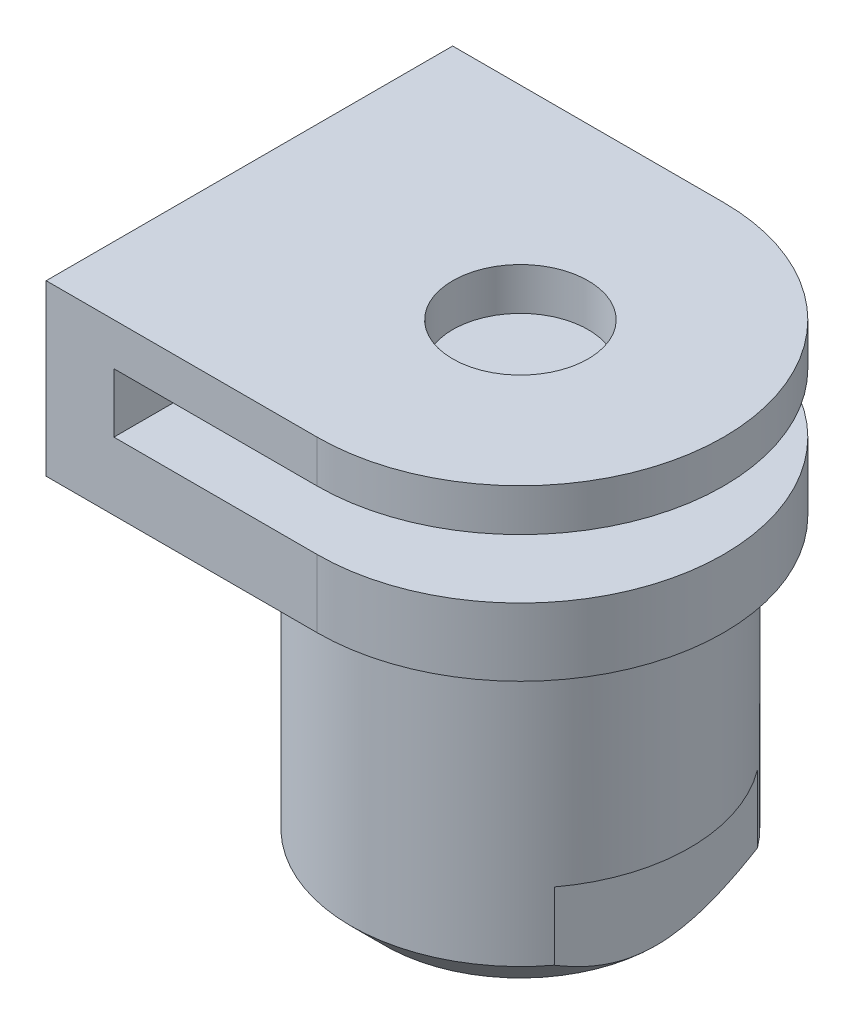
ISO-10303-21;
HEADER;
FILE_DESCRIPTION(('STEP AP214'),'2;1');
FILE_NAME('part.step','',(''),(''),'','','');
FILE_SCHEMA(('AUTOMOTIVE_DESIGN { 1 0 10303 214 1 1 1 1 }'));
ENDSEC;
DATA;
#1=APPLICATION_CONTEXT('core data for automotive mechanical design processes');
#2=APPLICATION_PROTOCOL_DEFINITION('international standard','automotive_design',2000,#1);
#3=PRODUCT_CONTEXT('',#1,'mechanical');
#4=PRODUCT('Part','Part','',(#3));
#5=PRODUCT_RELATED_PRODUCT_CATEGORY('part','',(#4));
#6=PRODUCT_DEFINITION_FORMATION('','',#4);
#7=PRODUCT_DEFINITION_CONTEXT('part definition',#1,'design');
#8=PRODUCT_DEFINITION('design','',#6,#7);
#9=PRODUCT_DEFINITION_SHAPE('','',#8);
#10=(LENGTH_UNIT() NAMED_UNIT(*) SI_UNIT(.MILLI.,.METRE.));
#11=(NAMED_UNIT(*) PLANE_ANGLE_UNIT() SI_UNIT($,.RADIAN.));
#12=(NAMED_UNIT(*) SI_UNIT($,.STERADIAN.) SOLID_ANGLE_UNIT());
#13=UNCERTAINTY_MEASURE_WITH_UNIT(LENGTH_MEASURE(1.E-05),#10,'distance_accuracy_value','');
#14=(GEOMETRIC_REPRESENTATION_CONTEXT(3) GLOBAL_UNCERTAINTY_ASSIGNED_CONTEXT((#13)) GLOBAL_UNIT_ASSIGNED_CONTEXT((#10,
#11,#12)) REPRESENTATION_CONTEXT('',''));
#15=CARTESIAN_POINT('',(0.,0.,0.));
#16=DIRECTION('',(0.,0.,1.));
#17=DIRECTION('',(1.,0.,0.));
#18=AXIS2_PLACEMENT_3D('',#15,#16,#17);
#19=CARTESIAN_POINT('',(0.,9.,0.));
#20=DIRECTION('',(0.,1.,0.));
#21=DIRECTION('',(0.,0.,1.));
#22=AXIS2_PLACEMENT_3D('',#19,#20,#21);
#23=PLANE('',#22);
#24=DIRECTION('',(1.,0.,0.));
#25=VECTOR('',#24,1.);
#26=CARTESIAN_POINT('',(-8.,9.,0.5));
#27=LINE('',#26,#25);
#28=CARTESIAN_POINT('',(-8.,9.,0.5));
#29=VERTEX_POINT('',#28);
#30=CARTESIAN_POINT('',(-4.9749371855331,9.,0.5));
#31=VERTEX_POINT('',#30);
#32=EDGE_CURVE('E61',#29,#31,#27,.T.);
#33=ORIENTED_EDGE('',*,*,#32,.T.);
#34=CARTESIAN_POINT('',(0.,9.,0.));
#35=DIRECTION('',(0.,1.,0.));
#36=DIRECTION('',(0.,0.,1.));
#37=AXIS2_PLACEMENT_3D('',#34,#35,#36);
#38=CIRCLE('',#37,5.);
#39=CARTESIAN_POINT('',(-4.9749371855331,9.,-0.5));
#40=VERTEX_POINT('',#39);
#41=EDGE_CURVE('E263',#31,#40,#38,.T.);
#42=ORIENTED_EDGE('',*,*,#41,.T.);
#43=DIRECTION('',(-1.,0.,0.));
#44=VECTOR('',#43,1.);
#45=CARTESIAN_POINT('',(6.001,9.,-0.5));
#46=LINE('',#45,#44);
#47=CARTESIAN_POINT('',(-8.,9.,-0.5));
#48=VERTEX_POINT('',#47);
#49=EDGE_CURVE('E183',#40,#48,#46,.T.);
#50=ORIENTED_EDGE('',*,*,#49,.T.);
#51=DIRECTION('',(0.,0.,1.));
#52=VECTOR('',#51,1.);
#53=CARTESIAN_POINT('',(-8.,9.,-6.));
#54=LINE('',#53,#52);
#55=CARTESIAN_POINT('',(-8.,9.,-6.));
#56=VERTEX_POINT('',#55);
#57=EDGE_CURVE('E198',#56,#48,#54,.T.);
#58=ORIENTED_EDGE('',*,*,#57,.F.);
#59=DIRECTION('',(-1.,0.,0.));
#60=VECTOR('',#59,1.);
#61=CARTESIAN_POINT('',(0.,9.,-6.));
#62=LINE('',#61,#60);
#63=CARTESIAN_POINT('',(0.,9.,-6.));
#64=VERTEX_POINT('',#63);
#65=EDGE_CURVE('E234',#64,#56,#62,.T.);
#66=ORIENTED_EDGE('',*,*,#65,.F.);
#67=CARTESIAN_POINT('',(0.,9.,0.));
#68=DIRECTION('',(0.,1.,0.));
#69=DIRECTION('',(0.,0.,1.));
#70=AXIS2_PLACEMENT_3D('',#67,#68,#69);
#71=CIRCLE('',#70,6.);
#72=CARTESIAN_POINT('',(0.,9.,6.));
#73=VERTEX_POINT('',#72);
#74=EDGE_CURVE('E218',#73,#64,#71,.T.);
#75=ORIENTED_EDGE('',*,*,#74,.F.);
#76=DIRECTION('',(1.,0.,0.));
#77=VECTOR('',#76,1.);
#78=CARTESIAN_POINT('',(-6.,9.,6.));
#79=LINE('',#78,#77);
#80=CARTESIAN_POINT('',(-8.,9.,6.));
#81=VERTEX_POINT('',#80);
#82=EDGE_CURVE('E223',#81,#73,#79,.T.);
#83=ORIENTED_EDGE('',*,*,#82,.F.);
#84=EDGE_CURVE('E195',#29,#81,#54,.T.);
#85=ORIENTED_EDGE('',*,*,#84,.F.);
#86=EDGE_LOOP('',(#33,#42,#50,#58,#66,#75,#83,#85));
#87=FACE_BOUND('',#86,.T.);
#88=ADVANCED_FACE('F35',(#87),#23,.F.);
#89=CARTESIAN_POINT('',(0.,9.,0.));
#90=DIRECTION('',(0.,-1.,0.));
#91=DIRECTION('',(0.,0.,-1.));
#92=AXIS2_PLACEMENT_3D('',#89,#90,#91);
#93=CYLINDRICAL_SURFACE('',#92,5.);
#94=CARTESIAN_POINT('',(0.,3.,0.));
#95=DIRECTION('',(0.,-1.,0.));
#96=DIRECTION('',(0.,0.,-1.));
#97=AXIS2_PLACEMENT_3D('',#94,#95,#96);
#98=CIRCLE('',#97,5.);
#99=CARTESIAN_POINT('',(4.,3.,-3.));
#100=VERTEX_POINT('',#99);
#101=CARTESIAN_POINT('',(4.,3.,3.));
#102=VERTEX_POINT('',#101);
#103=EDGE_CURVE('E12',#100,#102,#98,.T.);
#104=ORIENTED_EDGE('',*,*,#103,.F.);
#105=DIRECTION('',(0.,-1.,0.));
#106=VECTOR('',#105,1.);
#107=CARTESIAN_POINT('',(4.,9.,-3.));
#108=LINE('',#107,#106);
#109=CARTESIAN_POINT('',(4.,1.00000000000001,-3.00000000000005));
#110=VERTEX_POINT('',#109);
#111=EDGE_CURVE('E257',#100,#110,#108,.T.);
#112=ORIENTED_EDGE('',*,*,#111,.T.);
#113=CARTESIAN_POINT('',(0.,1.,0.));
#114=DIRECTION('',(0.,1.,0.));
#115=DIRECTION('',(0.,0.,1.));
#116=AXIS2_PLACEMENT_3D('',#113,#114,#115);
#117=CIRCLE('',#116,5.);
#118=CARTESIAN_POINT('',(-4.,1.00000000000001,-3.00000000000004));
#119=VERTEX_POINT('',#118);
#120=EDGE_CURVE('E268',#110,#119,#117,.T.);
#121=ORIENTED_EDGE('',*,*,#120,.T.);
#122=DIRECTION('',(0.,-1.,0.));
#123=VECTOR('',#122,1.);
#124=CARTESIAN_POINT('',(-4.,9.,-3.));
#125=LINE('',#124,#123);
#126=CARTESIAN_POINT('',(-4.,3.,-3.));
#127=VERTEX_POINT('',#126);
#128=EDGE_CURVE('E246',#119,#127,#125,.F.);
#129=ORIENTED_EDGE('',*,*,#128,.T.);
#130=CARTESIAN_POINT('',(0.,3.,0.));
#131=DIRECTION('',(0.,1.,0.));
#132=DIRECTION('',(0.,0.,1.));
#133=AXIS2_PLACEMENT_3D('',#130,#131,#132);
#134=CIRCLE('',#133,5.);
#135=CARTESIAN_POINT('',(-4.,3.,3.));
#136=VERTEX_POINT('',#135);
#137=EDGE_CURVE('E45',#127,#136,#134,.T.);
#138=ORIENTED_EDGE('',*,*,#137,.T.);
#139=DIRECTION('',(0.,-1.,0.));
#140=VECTOR('',#139,1.);
#141=CARTESIAN_POINT('',(-4.,9.,3.));
#142=LINE('',#141,#140);
#143=CARTESIAN_POINT('',(-4.,1.,3.));
#144=VERTEX_POINT('',#143);
#145=EDGE_CURVE('E251',#136,#144,#142,.T.);
#146=ORIENTED_EDGE('',*,*,#145,.T.);
#147=CARTESIAN_POINT('',(4.,1.,3.));
#148=VERTEX_POINT('',#147);
#149=EDGE_CURVE('E265',#144,#148,#117,.T.);
#150=ORIENTED_EDGE('',*,*,#149,.T.);
#151=DIRECTION('',(0.,-1.,0.));
#152=VECTOR('',#151,1.);
#153=CARTESIAN_POINT('',(4.,9.,3.));
#154=LINE('',#153,#152);
#155=EDGE_CURVE('E254',#148,#102,#154,.F.);
#156=ORIENTED_EDGE('',*,*,#155,.T.);
#157=EDGE_LOOP('',(#104,#112,#121,#129,#138,#146,#150,#156));
#158=FACE_BOUND('',#157,.T.);
#159=DIRECTION('',(0.,-1.,0.));
#160=VECTOR('',#159,1.);
#161=CARTESIAN_POINT('',(-4.9749371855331,9.,0.5));
#162=LINE('',#161,#160);
#163=CARTESIAN_POINT('',(-4.9749371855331,5.,0.5));
#164=VERTEX_POINT('',#163);
#165=EDGE_CURVE('E53',#31,#164,#162,.T.);
#166=ORIENTED_EDGE('',*,*,#165,.T.);
#167=CARTESIAN_POINT('',(0.,5.,0.));
#168=DIRECTION('',(0.,1.,0.));
#169=DIRECTION('',(0.,0.,1.));
#170=AXIS2_PLACEMENT_3D('',#167,#168,#169);
#171=CIRCLE('',#170,5.);
#172=CARTESIAN_POINT('',(-5.,5.,0.));
#173=VERTEX_POINT('',#172);
#174=EDGE_CURVE('E178',#164,#173,#171,.F.);
#175=ORIENTED_EDGE('',*,*,#174,.T.);
#176=CARTESIAN_POINT('',(0.,5.,0.));
#177=DIRECTION('',(0.,1.,0.));
#178=DIRECTION('',(0.,0.,1.));
#179=AXIS2_PLACEMENT_3D('',#176,#177,#178);
#180=CIRCLE('',#179,5.);
#181=CARTESIAN_POINT('',(-4.9749371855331,5.,-0.5));
#182=VERTEX_POINT('',#181);
#183=EDGE_CURVE('E556',#173,#182,#180,.F.);
#184=ORIENTED_EDGE('',*,*,#183,.T.);
#185=DIRECTION('',(0.,-1.,0.));
#186=VECTOR('',#185,1.);
#187=CARTESIAN_POINT('',(-4.9749371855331,9.,-0.5));
#188=LINE('',#187,#186);
#189=EDGE_CURVE('E190',#182,#40,#188,.F.);
#190=ORIENTED_EDGE('',*,*,#189,.T.);
#191=ORIENTED_EDGE('',*,*,#41,.F.);
#192=EDGE_LOOP('',(#166,#175,#184,#190,#191));
#193=FACE_BOUND('',#192,.T.);
#194=ADVANCED_FACE('F304',(#158,#193),#93,.T.);
#195=CARTESIAN_POINT('',(-6.,9.,-6.));
#196=DIRECTION('',(1.,0.,0.));
#197=DIRECTION('',(0.,0.,-1.));
#198=AXIS2_PLACEMENT_3D('',#195,#196,#197);
#199=PLANE('',#198);
#200=DIRECTION('',(0.,1.,0.));
#201=VECTOR('',#200,1.);
#202=CARTESIAN_POINT('',(-6.,9.,-6.));
#203=LINE('',#202,#201);
#204=CARTESIAN_POINT('',(-6.,11.,-6.));
#205=VERTEX_POINT('',#204);
#206=CARTESIAN_POINT('',(-6.,12.75,-6.));
#207=VERTEX_POINT('',#206);
#208=EDGE_CURVE('E213',#205,#207,#203,.T.);
#209=ORIENTED_EDGE('',*,*,#208,.T.);
#210=DIRECTION('',(0.,0.,1.));
#211=VECTOR('',#210,1.);
#212=CARTESIAN_POINT('',(-6.,12.75,-6.));
#213=LINE('',#212,#211);
#214=CARTESIAN_POINT('',(-6.,12.75,6.));
#215=VERTEX_POINT('',#214);
#216=EDGE_CURVE('E586',#207,#215,#213,.T.);
#217=ORIENTED_EDGE('',*,*,#216,.T.);
#218=DIRECTION('',(0.,1.,0.));
#219=VECTOR('',#218,1.);
#220=CARTESIAN_POINT('',(-6.,9.,6.));
#221=LINE('',#220,#219);
#222=CARTESIAN_POINT('',(-6.,11.,6.));
#223=VERTEX_POINT('',#222);
#224=EDGE_CURVE('E204',#223,#215,#221,.T.);
#225=ORIENTED_EDGE('',*,*,#224,.F.);
#226=DIRECTION('',(0.,0.,1.));
#227=VECTOR('',#226,1.);
#228=CARTESIAN_POINT('',(-6.,11.,-6.));
#229=LINE('',#228,#227);
#230=EDGE_CURVE('E226',#205,#223,#229,.T.);
#231=ORIENTED_EDGE('',*,*,#230,.F.);
#232=EDGE_LOOP('',(#209,#217,#225,#231));
#233=FACE_BOUND('',#232,.T.);
#234=ADVANCED_FACE('F306',(#233),#199,.T.);
#235=CARTESIAN_POINT('',(0.,1.,0.));
#236=DIRECTION('',(0.,1.,0.));
#237=DIRECTION('',(0.,0.,1.));
#238=AXIS2_PLACEMENT_3D('',#235,#236,#237);
#239=CONICAL_SURFACE('',#238,5.,0.785398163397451);
#240=CARTESIAN_POINT('',(4.,4.98945966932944,-8.05048974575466));
#241=CARTESIAN_POINT('',(4.,4.82495657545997,-7.86677314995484));
#242=CARTESIAN_POINT('',(4.,4.6610445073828,-7.68252259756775));
#243=CARTESIAN_POINT('',(4.,4.33471600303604,-7.31267247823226));
#244=CARTESIAN_POINT('',(4.,4.17229970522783,-7.12707278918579));
#245=CARTESIAN_POINT('',(4.,3.84870393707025,-6.75358129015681));
#246=CARTESIAN_POINT('',(4.,3.68753134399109,-6.5656835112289));
#247=CARTESIAN_POINT('',(4.,3.36751725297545,-6.18792336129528));
#248=CARTESIAN_POINT('',(4.,3.20867565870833,-5.99806107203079));
#249=CARTESIAN_POINT('',(4.,2.88467626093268,-5.60463737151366));
#250=CARTESIAN_POINT('',(4.,2.7196977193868,-5.40092791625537));
#251=CARTESIAN_POINT('',(4.,2.39412100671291,-4.99004131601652));
#252=CARTESIAN_POINT('',(4.,2.23352259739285,-4.78286436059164));
#253=CARTESIAN_POINT('',(4.,1.91848935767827,-4.36434256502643));
#254=CARTESIAN_POINT('',(4.,1.76404563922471,-4.15300444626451));
#255=CARTESIAN_POINT('',(4.,1.46342148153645,-3.72455976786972));
#256=CARTESIAN_POINT('',(4.,1.31723853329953,-3.50745498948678));
#257=CARTESIAN_POINT('',(4.,1.07455586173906,-3.12515751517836));
#258=CARTESIAN_POINT('',(4.,0.975280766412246,-2.96173607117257));
#259=CARTESIAN_POINT('',(4.,0.785179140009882,-2.62991642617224));
#260=CARTESIAN_POINT('',(4.,0.694355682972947,-2.46151644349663));
#261=CARTESIAN_POINT('',(4.,0.524899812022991,-2.12047804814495));
#262=CARTESIAN_POINT('',(4.,0.446166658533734,-1.94789030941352));
#263=CARTESIAN_POINT('',(4.,0.303868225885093,-1.59655754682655));
#264=CARTESIAN_POINT('',(4.,0.240291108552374,-1.41781745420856));
#265=CARTESIAN_POINT('',(4.,0.152093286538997,-1.11909704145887));
#266=CARTESIAN_POINT('',(4.,0.121660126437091,-1.00083492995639));
#267=CARTESIAN_POINT('',(4.,0.0703149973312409,-0.762246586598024));
#268=CARTESIAN_POINT('',(4.,0.0494014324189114,-0.641920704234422));
#269=CARTESIAN_POINT('',(4.,0.018210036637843,-0.400362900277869));
#270=CARTESIAN_POINT('',(4.,0.00789045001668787,-0.279136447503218));
#271=CARTESIAN_POINT('',(4.,-0.00167644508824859,-0.0362406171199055));
#272=CARTESIAN_POINT('',(4.,-0.000923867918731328,0.0854287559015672));
#273=CARTESIAN_POINT('',(4.,0.011582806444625,0.327677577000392));
#274=CARTESIAN_POINT('',(4.,0.0232906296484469,0.448259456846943));
#275=CARTESIAN_POINT('',(4.,0.0569967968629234,0.68798211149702));
#276=CARTESIAN_POINT('',(4.,0.078997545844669,0.807122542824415));
#277=CARTESIAN_POINT('',(4.,0.13253015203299,1.04468446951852));
#278=CARTESIAN_POINT('',(4.,0.164170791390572,1.16308113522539));
#279=CARTESIAN_POINT('',(4.,0.235577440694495,1.39734273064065));
#280=CARTESIAN_POINT('',(4.,0.275342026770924,1.51320810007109));
#281=CARTESIAN_POINT('',(4.,0.374287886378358,1.77572186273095));
#282=CARTESIAN_POINT('',(4.,0.435751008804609,1.92150570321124));
#283=CARTESIAN_POINT('',(4.,0.567638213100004,2.208992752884));
#284=CARTESIAN_POINT('',(4.,0.638067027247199,2.35069375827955));
#285=CARTESIAN_POINT('',(4.,0.786162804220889,2.63088310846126));
#286=CARTESIAN_POINT('',(4.,0.863854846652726,2.7693580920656));
#287=CARTESIAN_POINT('',(4.,1.02471777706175,3.0430311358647));
#288=CARTESIAN_POINT('',(4.,1.1078876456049,3.17822979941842));
#289=CARTESIAN_POINT('',(4.,1.27435701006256,3.43924936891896));
#290=CARTESIAN_POINT('',(4.,1.35744794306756,3.5652039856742));
#291=CARTESIAN_POINT('',(4.,1.52680425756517,3.8149685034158));
#292=CARTESIAN_POINT('',(4.,1.61306989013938,3.93877823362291));
#293=CARTESIAN_POINT('',(4.,1.78741756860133,4.18348220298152));
#294=CARTESIAN_POINT('',(4.,1.87547722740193,4.3043924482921));
#295=CARTESIAN_POINT('',(4.,2.05368586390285,4.54461496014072));
#296=CARTESIAN_POINT('',(4.,2.14383427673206,4.66392764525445));
#297=CARTESIAN_POINT('',(4.,2.23482802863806,4.7825809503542));
#298=B_SPLINE_CURVE_WITH_KNOTS('',3,(#240,#241,#242,#243,#244,#245,#246,#247,#248,#249,#250,
#251,#252,#253,#254,#255,#256,#257,#258,#259,#260,#261,#262,#263,#264,#265,#266,#267,#268,#269,
#270,#271,#272,#273,#274,#275,#276,#277,#278,#279,#280,#281,#282,#283,#284,#285,#286,#287,#288,
#289,#290,#291,#292,#293,#294,#295,#296,#297),.UNSPECIFIED.,.F.,.F.,(4,2,2,2,2,2,2,2,2,2,2,2,2,
2,2,2,2,2,2,2,2,2,2,2,2,2,2,2,4),(0.,0.739813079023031,1.47969396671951,2.22233588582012,
2.96494702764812,3.75131185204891,4.53763382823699,5.32277576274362,6.10767793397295,
6.68113117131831,7.25479217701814,7.82337832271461,8.39151888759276,8.75753515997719,
9.12349004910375,9.48799693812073,9.85250006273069,10.2154704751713,10.578525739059,
10.9458400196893,11.3130899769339,11.7873179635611,12.2617973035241,12.7379801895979,
13.2140747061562,13.6666961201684,14.1193534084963,14.5680650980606,15.0166568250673),.UNSPECIFIED.);
#299=CARTESIAN_POINT('',(3.99999999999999,0.,0.));
#300=VERTEX_POINT('',#299);
#301=EDGE_CURVE('E324',#148,#300,#298,.F.);
#302=ORIENTED_EDGE('',*,*,#301,.F.);
#303=ORIENTED_EDGE('',*,*,#149,.F.);
#304=CARTESIAN_POINT('',(-4.,4.98945966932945,-8.05048974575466));
#305=CARTESIAN_POINT('',(-4.,4.82495657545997,-7.86677314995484));
#306=CARTESIAN_POINT('',(-4.,4.6610445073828,-7.68252259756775));
#307=CARTESIAN_POINT('',(-4.,4.33471600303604,-7.31267247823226));
#308=CARTESIAN_POINT('',(-4.,4.17229970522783,-7.12707278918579));
#309=CARTESIAN_POINT('',(-4.,3.84870393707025,-6.75358129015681));
#310=CARTESIAN_POINT('',(-4.,3.68753134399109,-6.5656835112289));
#311=CARTESIAN_POINT('',(-4.,3.36751725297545,-6.18792336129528));
#312=CARTESIAN_POINT('',(-4.,3.20867565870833,-5.99806107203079));
#313=CARTESIAN_POINT('',(-4.,2.88467626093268,-5.60463737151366));
#314=CARTESIAN_POINT('',(-4.,2.7196977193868,-5.40092791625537));
#315=CARTESIAN_POINT('',(-4.,2.39412100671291,-4.99004131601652));
#316=CARTESIAN_POINT('',(-4.,2.23352259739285,-4.78286436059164));
#317=CARTESIAN_POINT('',(-4.,1.91848935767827,-4.36434256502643));
#318=CARTESIAN_POINT('',(-4.,1.76404563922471,-4.15300444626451));
#319=CARTESIAN_POINT('',(-4.,1.46342148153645,-3.72455976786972));
#320=CARTESIAN_POINT('',(-4.,1.31723853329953,-3.50745498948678));
#321=CARTESIAN_POINT('',(-4.,1.07455586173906,-3.12515751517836));
#322=CARTESIAN_POINT('',(-4.,0.975280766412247,-2.96173607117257));
#323=CARTESIAN_POINT('',(-4.,0.785179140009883,-2.62991642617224));
#324=CARTESIAN_POINT('',(-4.,0.694355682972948,-2.46151644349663));
#325=CARTESIAN_POINT('',(-4.,0.524899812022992,-2.12047804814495));
#326=CARTESIAN_POINT('',(-4.,0.446166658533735,-1.94789030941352));
#327=CARTESIAN_POINT('',(-4.,0.303868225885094,-1.59655754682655));
#328=CARTESIAN_POINT('',(-4.,0.240291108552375,-1.41781745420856));
#329=CARTESIAN_POINT('',(-4.,0.152093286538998,-1.11909704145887));
#330=CARTESIAN_POINT('',(-4.,0.121660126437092,-1.00083492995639));
#331=CARTESIAN_POINT('',(-4.,0.0703149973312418,-0.762246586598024));
#332=CARTESIAN_POINT('',(-4.,0.0494014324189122,-0.641920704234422));
#333=CARTESIAN_POINT('',(-4.,0.0182100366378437,-0.400362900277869));
#334=CARTESIAN_POINT('',(-4.,0.00789045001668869,-0.279136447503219));
#335=CARTESIAN_POINT('',(-4.,-0.00167644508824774,-0.036240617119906));
#336=CARTESIAN_POINT('',(-4.,-0.00092386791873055,0.0854287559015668));
#337=CARTESIAN_POINT('',(-4.,0.0115828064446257,0.327677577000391));
#338=CARTESIAN_POINT('',(-4.,0.0232906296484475,0.448259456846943));
#339=CARTESIAN_POINT('',(-4.,0.0569967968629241,0.68798211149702));
#340=CARTESIAN_POINT('',(-4.,0.0789975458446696,0.807122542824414));
#341=CARTESIAN_POINT('',(-4.,0.132530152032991,1.04468446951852));
#342=CARTESIAN_POINT('',(-4.,0.164170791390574,1.16308113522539));
#343=CARTESIAN_POINT('',(-4.,0.235577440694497,1.39734273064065));
#344=CARTESIAN_POINT('',(-4.,0.275342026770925,1.51320810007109));
#345=CARTESIAN_POINT('',(-4.,0.374287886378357,1.77572186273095));
#346=CARTESIAN_POINT('',(-4.,0.435751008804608,1.92150570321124));
#347=CARTESIAN_POINT('',(-4.,0.567638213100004,2.208992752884));
#348=CARTESIAN_POINT('',(-4.,0.638067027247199,2.35069375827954));
#349=CARTESIAN_POINT('',(-4.,0.786162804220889,2.63088310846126));
#350=CARTESIAN_POINT('',(-4.,0.863854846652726,2.76935809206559));
#351=CARTESIAN_POINT('',(-4.,1.02471777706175,3.04303113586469));
#352=CARTESIAN_POINT('',(-4.,1.1078876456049,3.17822979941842));
#353=CARTESIAN_POINT('',(-4.,1.27435701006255,3.43924936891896));
#354=CARTESIAN_POINT('',(-4.,1.35744794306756,3.5652039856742));
#355=CARTESIAN_POINT('',(-4.,1.52680425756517,3.8149685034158));
#356=CARTESIAN_POINT('',(-4.,1.61306989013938,3.93877823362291));
#357=CARTESIAN_POINT('',(-4.,1.78741756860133,4.18348220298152));
#358=CARTESIAN_POINT('',(-4.,1.87547722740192,4.3043924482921));
#359=CARTESIAN_POINT('',(-4.,2.05368586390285,4.54461496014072));
#360=CARTESIAN_POINT('',(-4.,2.14383427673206,4.66392764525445));
#361=CARTESIAN_POINT('',(-4.,2.23482802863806,4.7825809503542));
#362=B_SPLINE_CURVE_WITH_KNOTS('',3,(#304,#305,#306,#307,#308,#309,#310,#311,#312,#313,#314,
#315,#316,#317,#318,#319,#320,#321,#322,#323,#324,#325,#326,#327,#328,#329,#330,#331,#332,#333,
#334,#335,#336,#337,#338,#339,#340,#341,#342,#343,#344,#345,#346,#347,#348,#349,#350,#351,#352,
#353,#354,#355,#356,#357,#358,#359,#360,#361),.UNSPECIFIED.,.F.,.F.,(4,2,2,2,2,2,2,2,2,2,2,2,2,
2,2,2,2,2,2,2,2,2,2,2,2,2,2,2,4),(0.,0.739813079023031,1.47969396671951,2.22233588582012,
2.96494702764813,3.75131185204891,4.53763382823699,5.32277576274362,6.10767793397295,
6.68113117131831,7.25479217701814,7.82337832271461,8.39151888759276,8.75753515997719,
9.12349004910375,9.48799693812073,9.85250006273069,10.2154704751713,10.578525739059,
10.9458400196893,11.3130899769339,11.7873179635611,12.2617973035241,12.7379801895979,
13.2140747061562,13.6666961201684,14.1193534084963,14.5680650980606,15.0166568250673),.UNSPECIFIED.);
#363=CARTESIAN_POINT('',(-3.99999999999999,0.,0.));
#364=VERTEX_POINT('',#363);
#365=EDGE_CURVE('E272',#364,#144,#362,.T.);
#366=ORIENTED_EDGE('',*,*,#365,.F.);
#367=CARTESIAN_POINT('',(0.,0.,0.));
#368=DIRECTION('',(0.,1.,0.));
#369=DIRECTION('',(0.,0.,1.));
#370=AXIS2_PLACEMENT_3D('',#367,#368,#369);
#371=CIRCLE('',#370,3.99999999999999);
#372=EDGE_CURVE('E273',#300,#364,#371,.F.);
#373=ORIENTED_EDGE('',*,*,#372,.F.);
#374=EDGE_LOOP('',(#302,#303,#366,#373));
#375=FACE_BOUND('',#374,.T.);
#376=ADVANCED_FACE('F302',(#375),#239,.T.);
#377=CARTESIAN_POINT('',(0.,0.,0.));
#378=DIRECTION('',(0.,1.,0.));
#379=DIRECTION('',(0.,0.,1.));
#380=AXIS2_PLACEMENT_3D('',#377,#378,#379);
#381=PLANE('',#380);
#382=EDGE_CURVE('E269',#364,#300,#371,.F.);
#383=ORIENTED_EDGE('',*,*,#382,.T.);
#384=ORIENTED_EDGE('',*,*,#372,.T.);
#385=EDGE_LOOP('',(#383,#384));
#386=FACE_BOUND('',#385,.T.);
#387=CARTESIAN_POINT('',(0.,0.,0.));
#388=DIRECTION('',(0.,1.,0.));
#389=DIRECTION('',(0.,0.,1.));
#390=AXIS2_PLACEMENT_3D('',#387,#388,#389);
#391=CIRCLE('',#390,2.);
#392=CARTESIAN_POINT('',(0.,0.,2.));
#393=VERTEX_POINT('',#392);
#394=EDGE_CURVE('E260',#393,#393,#391,.T.);
#395=ORIENTED_EDGE('',*,*,#394,.T.);
#396=EDGE_LOOP('',(#395));
#397=FACE_BOUND('',#396,.T.);
#398=ADVANCED_FACE('F299',(#386,#397),#381,.F.);
#399=CARTESIAN_POINT('',(0.,9.,0.));
#400=DIRECTION('',(0.,-1.,0.));
#401=DIRECTION('',(0.,0.,-1.));
#402=AXIS2_PLACEMENT_3D('',#399,#400,#401);
#403=CYLINDRICAL_SURFACE('',#402,2.);
#404=ORIENTED_EDGE('',*,*,#394,.F.);
#405=EDGE_LOOP('',(#404));
#406=FACE_BOUND('',#405,.T.);
#407=CARTESIAN_POINT('',(0.,11.,0.));
#408=DIRECTION('',(0.,1.,0.));
#409=DIRECTION('',(0.,0.,1.));
#410=AXIS2_PLACEMENT_3D('',#407,#408,#409);
#411=CIRCLE('',#410,2.);
#412=CARTESIAN_POINT('',(0.,11.,2.));
#413=VERTEX_POINT('',#412);
#414=EDGE_CURVE('E208',#413,#413,#411,.T.);
#415=ORIENTED_EDGE('',*,*,#414,.T.);
#416=EDGE_LOOP('',(#415));
#417=FACE_BOUND('',#416,.T.);
#418=ADVANCED_FACE('F296',(#406,#417),#403,.F.);
#419=EDGE_CURVE('E281',#300,#110,#298,.F.);
#420=ORIENTED_EDGE('',*,*,#419,.F.);
#421=ORIENTED_EDGE('',*,*,#382,.F.);
#422=EDGE_CURVE('E280',#119,#364,#362,.T.);
#423=ORIENTED_EDGE('',*,*,#422,.F.);
#424=ORIENTED_EDGE('',*,*,#120,.F.);
#425=EDGE_LOOP('',(#420,#421,#423,#424));
#426=FACE_BOUND('',#425,.T.);
#427=ADVANCED_FACE('F37',(#426),#239,.T.);
#428=CARTESIAN_POINT('',(0.,3.,0.));
#429=DIRECTION('',(0.,1.,0.));
#430=DIRECTION('',(0.,0.,1.));
#431=AXIS2_PLACEMENT_3D('',#428,#429,#430);
#432=PLANE('',#431);
#433=DIRECTION('',(0.,0.,1.));
#434=VECTOR('',#433,1.);
#435=CARTESIAN_POINT('',(-4.,3.,5.42579871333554));
#436=LINE('',#435,#434);
#437=EDGE_CURVE('E242',#127,#136,#436,.T.);
#438=ORIENTED_EDGE('',*,*,#437,.T.);
#439=ORIENTED_EDGE('',*,*,#137,.F.);
#440=EDGE_LOOP('',(#438,#439));
#441=FACE_BOUND('',#440,.T.);
#442=ADVANCED_FACE('F294',(#441),#432,.F.);
#443=CARTESIAN_POINT('',(-4.,3.,5.42579871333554));
#444=DIRECTION('',(1.,0.,0.));
#445=DIRECTION('',(0.,0.,-1.));
#446=AXIS2_PLACEMENT_3D('',#443,#444,#445);
#447=PLANE('',#446);
#448=ORIENTED_EDGE('',*,*,#437,.F.);
#449=ORIENTED_EDGE('',*,*,#128,.F.);
#450=ORIENTED_EDGE('',*,*,#422,.T.);
#451=ORIENTED_EDGE('',*,*,#365,.T.);
#452=ORIENTED_EDGE('',*,*,#145,.F.);
#453=EDGE_LOOP('',(#448,#449,#450,#451,#452));
#454=FACE_BOUND('',#453,.T.);
#455=ADVANCED_FACE('F288',(#454),#447,.F.);
#456=CARTESIAN_POINT('',(0.,3.,0.));
#457=DIRECTION('',(0.,-1.,0.));
#458=DIRECTION('',(0.,0.,-1.));
#459=AXIS2_PLACEMENT_3D('',#456,#457,#458);
#460=PLANE('',#459);
#461=ORIENTED_EDGE('',*,*,#103,.T.);
#462=DIRECTION('',(0.,0.,-1.));
#463=VECTOR('',#462,1.);
#464=CARTESIAN_POINT('',(4.,3.,5.42579871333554));
#465=LINE('',#464,#463);
#466=EDGE_CURVE('E243',#102,#100,#465,.T.);
#467=ORIENTED_EDGE('',*,*,#466,.T.);
#468=EDGE_LOOP('',(#461,#467));
#469=FACE_BOUND('',#468,.T.);
#470=ADVANCED_FACE('F293',(#469),#460,.T.);
#471=CARTESIAN_POINT('',(4.,3.,5.42579871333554));
#472=DIRECTION('',(-1.,0.,0.));
#473=DIRECTION('',(0.,0.,1.));
#474=AXIS2_PLACEMENT_3D('',#471,#472,#473);
#475=PLANE('',#474);
#476=ORIENTED_EDGE('',*,*,#466,.F.);
#477=ORIENTED_EDGE('',*,*,#155,.F.);
#478=ORIENTED_EDGE('',*,*,#301,.T.);
#479=ORIENTED_EDGE('',*,*,#419,.T.);
#480=ORIENTED_EDGE('',*,*,#111,.F.);
#481=EDGE_LOOP('',(#476,#477,#478,#479,#480));
#482=FACE_BOUND('',#481,.T.);
#483=ADVANCED_FACE('F321',(#482),#475,.F.);
#484=CARTESIAN_POINT('',(0.,11.,0.));
#485=DIRECTION('',(0.,1.,0.));
#486=DIRECTION('',(0.,0.,1.));
#487=AXIS2_PLACEMENT_3D('',#484,#485,#486);
#488=PLANE('',#487);
#489=CARTESIAN_POINT('',(0.,11.,0.));
#490=DIRECTION('',(0.,1.,0.));
#491=DIRECTION('',(0.,0.,1.));
#492=AXIS2_PLACEMENT_3D('',#489,#490,#491);
#493=CIRCLE('',#492,6.);
#494=CARTESIAN_POINT('',(0.,11.,6.));
#495=VERTEX_POINT('',#494);
#496=CARTESIAN_POINT('',(0.,11.,-6.));
#497=VERTEX_POINT('',#496);
#498=EDGE_CURVE('E219',#495,#497,#493,.T.);
#499=ORIENTED_EDGE('',*,*,#498,.T.);
#500=DIRECTION('',(-1.,0.,0.));
#501=VECTOR('',#500,1.);
#502=CARTESIAN_POINT('',(0.,11.,-6.));
#503=LINE('',#502,#501);
#504=EDGE_CURVE('E222',#497,#205,#503,.T.);
#505=ORIENTED_EDGE('',*,*,#504,.T.);
#506=ORIENTED_EDGE('',*,*,#230,.T.);
#507=DIRECTION('',(1.,0.,0.));
#508=VECTOR('',#507,1.);
#509=CARTESIAN_POINT('',(-6.,11.,6.));
#510=LINE('',#509,#508);
#511=EDGE_CURVE('E229',#223,#495,#510,.T.);
#512=ORIENTED_EDGE('',*,*,#511,.T.);
#513=EDGE_LOOP('',(#499,#505,#506,#512));
#514=FACE_BOUND('',#513,.T.);
#515=ORIENTED_EDGE('',*,*,#414,.F.);
#516=EDGE_LOOP('',(#515));
#517=FACE_BOUND('',#516,.T.);
#518=ADVANCED_FACE('F371',(#514,#517),#488,.T.);
#519=CARTESIAN_POINT('',(0.,11.,0.));
#520=DIRECTION('',(0.,-1.,0.));
#521=DIRECTION('',(0.,0.,-1.));
#522=AXIS2_PLACEMENT_3D('',#519,#520,#521);
#523=CYLINDRICAL_SURFACE('',#522,6.);
#524=ORIENTED_EDGE('',*,*,#74,.T.);
#525=DIRECTION('',(0.,-1.,0.));
#526=VECTOR('',#525,1.);
#527=CARTESIAN_POINT('',(0.,11.,-6.));
#528=LINE('',#527,#526);
#529=EDGE_CURVE('E239',#497,#64,#528,.T.);
#530=ORIENTED_EDGE('',*,*,#529,.F.);
#531=ORIENTED_EDGE('',*,*,#498,.F.);
#532=DIRECTION('',(0.,-1.,0.));
#533=VECTOR('',#532,1.);
#534=CARTESIAN_POINT('',(0.,11.,6.));
#535=LINE('',#534,#533);
#536=EDGE_CURVE('E231',#495,#73,#535,.T.);
#537=ORIENTED_EDGE('',*,*,#536,.T.);
#538=EDGE_LOOP('',(#524,#530,#531,#537));
#539=FACE_BOUND('',#538,.T.);
#540=ADVANCED_FACE('F365',(#539),#523,.T.);
#541=CARTESIAN_POINT('',(0.,11.,-6.));
#542=DIRECTION('',(0.,0.,1.));
#543=DIRECTION('',(1.,0.,0.));
#544=AXIS2_PLACEMENT_3D('',#541,#542,#543);
#545=PLANE('',#544);
#546=DIRECTION('',(-1.,0.,0.));
#547=VECTOR('',#546,1.);
#548=CARTESIAN_POINT('',(-6.,14.,-6.));
#549=LINE('',#548,#547);
#550=CARTESIAN_POINT('',(0.,14.,-6.));
#551=VERTEX_POINT('',#550);
#552=CARTESIAN_POINT('',(-8.,14.,-6.));
#553=VERTEX_POINT('',#552);
#554=EDGE_CURVE('E591',#551,#553,#549,.T.);
#555=ORIENTED_EDGE('',*,*,#554,.F.);
#556=DIRECTION('',(0.,1.,0.));
#557=VECTOR('',#556,1.);
#558=CARTESIAN_POINT('',(0.,12.75,-6.));
#559=LINE('',#558,#557);
#560=CARTESIAN_POINT('',(0.,12.75,-6.));
#561=VERTEX_POINT('',#560);
#562=EDGE_CURVE('E583',#561,#551,#559,.T.);
#563=ORIENTED_EDGE('',*,*,#562,.F.);
#564=DIRECTION('',(-1.,0.,0.));
#565=VECTOR('',#564,1.);
#566=CARTESIAN_POINT('',(-8.,12.75,-6.));
#567=LINE('',#566,#565);
#568=EDGE_CURVE('E577',#561,#207,#567,.T.);
#569=ORIENTED_EDGE('',*,*,#568,.T.);
#570=ORIENTED_EDGE('',*,*,#208,.F.);
#571=ORIENTED_EDGE('',*,*,#504,.F.);
#572=ORIENTED_EDGE('',*,*,#529,.T.);
#573=ORIENTED_EDGE('',*,*,#65,.T.);
#574=DIRECTION('',(0.,1.,0.));
#575=VECTOR('',#574,1.);
#576=CARTESIAN_POINT('',(-8.,9.,-6.));
#577=LINE('',#576,#575);
#578=EDGE_CURVE('E211',#56,#553,#577,.T.);
#579=ORIENTED_EDGE('',*,*,#578,.T.);
#580=EDGE_LOOP('',(#555,#563,#569,#570,#571,#572,#573,#579));
#581=FACE_BOUND('',#580,.T.);
#582=ADVANCED_FACE('F370',(#581),#545,.F.);
#583=CARTESIAN_POINT('',(-6.,11.,6.));
#584=DIRECTION('',(0.,0.,-1.));
#585=DIRECTION('',(-1.,0.,0.));
#586=AXIS2_PLACEMENT_3D('',#583,#584,#585);
#587=PLANE('',#586);
#588=DIRECTION('',(1.,0.,0.));
#589=VECTOR('',#588,1.);
#590=CARTESIAN_POINT('',(-6.,14.,6.));
#591=LINE('',#590,#589);
#592=CARTESIAN_POINT('',(-8.,14.,6.));
#593=VERTEX_POINT('',#592);
#594=CARTESIAN_POINT('',(0.,14.,6.));
#595=VERTEX_POINT('',#594);
#596=EDGE_CURVE('E199',#593,#595,#591,.T.);
#597=ORIENTED_EDGE('',*,*,#596,.F.);
#598=DIRECTION('',(0.,1.,0.));
#599=VECTOR('',#598,1.);
#600=CARTESIAN_POINT('',(-8.,9.,6.));
#601=LINE('',#600,#599);
#602=EDGE_CURVE('E209',#81,#593,#601,.T.);
#603=ORIENTED_EDGE('',*,*,#602,.F.);
#604=ORIENTED_EDGE('',*,*,#82,.T.);
#605=ORIENTED_EDGE('',*,*,#536,.F.);
#606=ORIENTED_EDGE('',*,*,#511,.F.);
#607=ORIENTED_EDGE('',*,*,#224,.T.);
#608=DIRECTION('',(1.,0.,0.));
#609=VECTOR('',#608,1.);
#610=CARTESIAN_POINT('',(-8.,12.75,6.));
#611=LINE('',#610,#609);
#612=CARTESIAN_POINT('',(0.,12.75,6.));
#613=VERTEX_POINT('',#612);
#614=EDGE_CURVE('E572',#215,#613,#611,.T.);
#615=ORIENTED_EDGE('',*,*,#614,.T.);
#616=DIRECTION('',(0.,1.,0.));
#617=VECTOR('',#616,1.);
#618=CARTESIAN_POINT('',(0.,12.75,6.));
#619=LINE('',#618,#617);
#620=EDGE_CURVE('E580',#613,#595,#619,.T.);
#621=ORIENTED_EDGE('',*,*,#620,.T.);
#622=EDGE_LOOP('',(#597,#603,#604,#605,#606,#607,#615,#621));
#623=FACE_BOUND('',#622,.T.);
#624=ADVANCED_FACE('F395',(#623),#587,.F.);
#625=CARTESIAN_POINT('',(-8.,9.,-6.));
#626=DIRECTION('',(-1.,0.,0.));
#627=DIRECTION('',(0.,0.,1.));
#628=AXIS2_PLACEMENT_3D('',#625,#626,#627);
#629=PLANE('',#628);
#630=DIRECTION('',(0.,0.,1.));
#631=VECTOR('',#630,1.);
#632=CARTESIAN_POINT('',(-8.,14.,-6.));
#633=LINE('',#632,#631);
#634=EDGE_CURVE('E593',#553,#593,#633,.T.);
#635=ORIENTED_EDGE('',*,*,#634,.F.);
#636=ORIENTED_EDGE('',*,*,#578,.F.);
#637=ORIENTED_EDGE('',*,*,#57,.T.);
#638=DIRECTION('',(0.,0.,-1.));
#639=VECTOR('',#638,1.);
#640=CARTESIAN_POINT('',(-8.,9.,0.));
#641=LINE('',#640,#639);
#642=EDGE_CURVE('E175',#29,#48,#641,.T.);
#643=ORIENTED_EDGE('',*,*,#642,.F.);
#644=ORIENTED_EDGE('',*,*,#84,.T.);
#645=ORIENTED_EDGE('',*,*,#602,.T.);
#646=EDGE_LOOP('',(#635,#636,#637,#643,#644,#645));
#647=FACE_BOUND('',#646,.T.);
#648=ADVANCED_FACE('F406',(#647),#629,.T.);
#649=CARTESIAN_POINT('',(0.,14.,0.));
#650=DIRECTION('',(0.,-1.,0.));
#651=DIRECTION('',(0.,0.,-1.));
#652=AXIS2_PLACEMENT_3D('',#649,#650,#651);
#653=PLANE('',#652);
#654=ORIENTED_EDGE('',*,*,#596,.T.);
#655=CARTESIAN_POINT('',(0.,14.,0.));
#656=DIRECTION('',(0.,1.,0.));
#657=DIRECTION('',(0.,0.,1.));
#658=AXIS2_PLACEMENT_3D('',#655,#656,#657);
#659=CIRCLE('',#658,6.);
#660=EDGE_CURVE('E570',#595,#551,#659,.T.);
#661=ORIENTED_EDGE('',*,*,#660,.T.);
#662=ORIENTED_EDGE('',*,*,#554,.T.);
#663=ORIENTED_EDGE('',*,*,#634,.T.);
#664=EDGE_LOOP('',(#654,#661,#662,#663));
#665=FACE_BOUND('',#664,.T.);
#666=CARTESIAN_POINT('',(0.,14.,0.));
#667=DIRECTION('',(0.,1.,0.));
#668=DIRECTION('',(0.,0.,1.));
#669=AXIS2_PLACEMENT_3D('',#666,#667,#668);
#670=CIRCLE('',#669,2.);
#671=CARTESIAN_POINT('',(0.,14.,2.));
#672=VERTEX_POINT('',#671);
#673=EDGE_CURVE('E559',#672,#672,#670,.T.);
#674=ORIENTED_EDGE('',*,*,#673,.F.);
#675=EDGE_LOOP('',(#674));
#676=FACE_BOUND('',#675,.T.);
#677=ADVANCED_FACE('F415',(#665,#676),#653,.F.);
#678=CARTESIAN_POINT('',(0.,12.75,0.));
#679=DIRECTION('',(0.,1.,0.));
#680=DIRECTION('',(0.,0.,1.));
#681=AXIS2_PLACEMENT_3D('',#678,#679,#680);
#682=CYLINDRICAL_SURFACE('',#681,6.);
#683=ORIENTED_EDGE('',*,*,#660,.F.);
#684=ORIENTED_EDGE('',*,*,#620,.F.);
#685=CARTESIAN_POINT('',(0.,12.75,0.));
#686=DIRECTION('',(0.,1.,0.));
#687=DIRECTION('',(0.,0.,1.));
#688=AXIS2_PLACEMENT_3D('',#685,#686,#687);
#689=CIRCLE('',#688,6.);
#690=EDGE_CURVE('E574',#613,#561,#689,.T.);
#691=ORIENTED_EDGE('',*,*,#690,.T.);
#692=ORIENTED_EDGE('',*,*,#562,.T.);
#693=EDGE_LOOP('',(#683,#684,#691,#692));
#694=FACE_BOUND('',#693,.T.);
#695=ADVANCED_FACE('F419',(#694),#682,.T.);
#696=CARTESIAN_POINT('',(0.,12.75,0.));
#697=DIRECTION('',(0.,1.,0.));
#698=DIRECTION('',(0.,0.,1.));
#699=AXIS2_PLACEMENT_3D('',#696,#697,#698);
#700=PLANE('',#699);
#701=ORIENTED_EDGE('',*,*,#216,.F.);
#702=ORIENTED_EDGE('',*,*,#568,.F.);
#703=ORIENTED_EDGE('',*,*,#690,.F.);
#704=ORIENTED_EDGE('',*,*,#614,.F.);
#705=EDGE_LOOP('',(#701,#702,#703,#704));
#706=FACE_BOUND('',#705,.T.);
#707=CARTESIAN_POINT('',(0.,12.75,0.));
#708=DIRECTION('',(0.,1.,0.));
#709=DIRECTION('',(0.,0.,1.));
#710=AXIS2_PLACEMENT_3D('',#707,#708,#709);
#711=CIRCLE('',#710,2.);
#712=CARTESIAN_POINT('',(0.,12.75,2.));
#713=VERTEX_POINT('',#712);
#714=EDGE_CURVE('E562',#713,#713,#711,.T.);
#715=ORIENTED_EDGE('',*,*,#714,.T.);
#716=EDGE_LOOP('',(#715));
#717=FACE_BOUND('',#716,.T.);
#718=ADVANCED_FACE('F429',(#706,#717),#700,.F.);
#719=CARTESIAN_POINT('',(0.,12.75,0.));
#720=DIRECTION('',(0.,1.,0.));
#721=DIRECTION('',(0.,0.,1.));
#722=AXIS2_PLACEMENT_3D('',#719,#720,#721);
#723=CYLINDRICAL_SURFACE('',#722,2.);
#724=ORIENTED_EDGE('',*,*,#714,.F.);
#725=EDGE_LOOP('',(#724));
#726=FACE_BOUND('',#725,.T.);
#727=ORIENTED_EDGE('',*,*,#673,.T.);
#728=EDGE_LOOP('',(#727));
#729=FACE_BOUND('',#728,.T.);
#730=ADVANCED_FACE('F439',(#726,#729),#723,.F.);
#731=CARTESIAN_POINT('',(6.001,5.,-0.5));
#732=DIRECTION('',(0.,0.,1.));
#733=DIRECTION('',(1.,0.,0.));
#734=AXIS2_PLACEMENT_3D('',#731,#732,#733);
#735=PLANE('',#734);
#736=ORIENTED_EDGE('',*,*,#189,.F.);
#737=DIRECTION('',(-1.,0.,0.));
#738=VECTOR('',#737,1.);
#739=CARTESIAN_POINT('',(6.001,5.,-0.5));
#740=LINE('',#739,#738);
#741=CARTESIAN_POINT('',(-5.,5.,-0.5));
#742=VERTEX_POINT('',#741);
#743=EDGE_CURVE('E185',#182,#742,#740,.T.);
#744=ORIENTED_EDGE('',*,*,#743,.T.);
#745=DIRECTION('',(-0.6,0.8,0.));
#746=VECTOR('',#745,1.);
#747=CARTESIAN_POINT('',(-5.,5.,-0.5));
#748=LINE('',#747,#746);
#749=EDGE_CURVE('E186',#742,#48,#748,.T.);
#750=ORIENTED_EDGE('',*,*,#749,.T.);
#751=ORIENTED_EDGE('',*,*,#49,.F.);
#752=EDGE_LOOP('',(#736,#744,#750,#751));
#753=FACE_BOUND('',#752,.T.);
#754=ADVANCED_FACE('F449',(#753),#735,.F.);
#755=CARTESIAN_POINT('',(6.001,5.,0.5));
#756=DIRECTION('',(0.,1.,0.));
#757=DIRECTION('',(0.,0.,1.));
#758=AXIS2_PLACEMENT_3D('',#755,#756,#757);
#759=PLANE('',#758);
#760=ORIENTED_EDGE('',*,*,#183,.F.);
#761=DIRECTION('',(0.,0.,-1.));
#762=VECTOR('',#761,1.);
#763=CARTESIAN_POINT('',(-5.,5.,0.5));
#764=LINE('',#763,#762);
#765=EDGE_CURVE('E172',#173,#742,#764,.T.);
#766=ORIENTED_EDGE('',*,*,#765,.T.);
#767=ORIENTED_EDGE('',*,*,#743,.F.);
#768=EDGE_LOOP('',(#760,#766,#767));
#769=FACE_BOUND('',#768,.T.);
#770=ADVANCED_FACE('F480',(#769),#759,.F.);
#771=CARTESIAN_POINT('',(-5.,5.,0.));
#772=DIRECTION('',(-0.8,-0.6,0.));
#773=DIRECTION('',(0.6,-0.8,0.));
#774=AXIS2_PLACEMENT_3D('',#771,#772,#773);
#775=PLANE('',#774);
#776=ORIENTED_EDGE('',*,*,#749,.F.);
#777=ORIENTED_EDGE('',*,*,#765,.F.);
#778=DIRECTION('',(0.,0.,-1.));
#779=VECTOR('',#778,1.);
#780=CARTESIAN_POINT('',(-5.,5.,0.));
#781=LINE('',#780,#779);
#782=CARTESIAN_POINT('',(-5.,5.,0.5));
#783=VERTEX_POINT('',#782);
#784=EDGE_CURVE('E166',#783,#173,#781,.T.);
#785=ORIENTED_EDGE('',*,*,#784,.F.);
#786=DIRECTION('',(-0.6,0.8,0.));
#787=VECTOR('',#786,1.);
#788=CARTESIAN_POINT('',(-5.,5.,0.5));
#789=LINE('',#788,#787);
#790=EDGE_CURVE('E158',#783,#29,#789,.T.);
#791=ORIENTED_EDGE('',*,*,#790,.T.);
#792=ORIENTED_EDGE('',*,*,#642,.T.);
#793=EDGE_LOOP('',(#776,#777,#785,#791,#792));
#794=FACE_BOUND('',#793,.T.);
#795=ADVANCED_FACE('F170',(#794),#775,.T.);
#796=CARTESIAN_POINT('',(0.,0.,0.5));
#797=DIRECTION('',(0.,0.,1.));
#798=DIRECTION('',(1.,0.,0.));
#799=AXIS2_PLACEMENT_3D('',#796,#797,#798);
#800=PLANE('',#799);
#801=ORIENTED_EDGE('',*,*,#790,.F.);
#802=DIRECTION('',(-1.,0.,0.));
#803=VECTOR('',#802,1.);
#804=CARTESIAN_POINT('',(6.001,5.,0.5));
#805=LINE('',#804,#803);
#806=EDGE_CURVE('E162',#164,#783,#805,.T.);
#807=ORIENTED_EDGE('',*,*,#806,.F.);
#808=ORIENTED_EDGE('',*,*,#165,.F.);
#809=ORIENTED_EDGE('',*,*,#32,.F.);
#810=EDGE_LOOP('',(#801,#807,#808,#809));
#811=FACE_BOUND('',#810,.T.);
#812=ADVANCED_FACE('F160',(#811),#800,.T.);
#813=CARTESIAN_POINT('',(6.001,5.,0.5));
#814=DIRECTION('',(0.,1.,0.));
#815=DIRECTION('',(0.,0.,1.));
#816=AXIS2_PLACEMENT_3D('',#813,#814,#815);
#817=PLANE('',#816);
#818=ORIENTED_EDGE('',*,*,#174,.F.);
#819=ORIENTED_EDGE('',*,*,#806,.T.);
#820=ORIENTED_EDGE('',*,*,#784,.T.);
#821=EDGE_LOOP('',(#818,#819,#820));
#822=FACE_BOUND('',#821,.T.);
#823=ADVANCED_FACE('F177',(#822),#817,.F.);
#824=CLOSED_SHELL('',(#88,#194,#234,#376,#398,#418,#427,#442,#455,#470,#483,#518,#540,#582,#624,
#648,#677,#695,#718,#730,#754,#770,#795,#812,#823));
#825=MANIFOLD_SOLID_BREP('B2',#824);
#826=ADVANCED_BREP_SHAPE_REPRESENTATION('',(#18,#825),#14);
#827=SHAPE_DEFINITION_REPRESENTATION(#9,#826);
ENDSEC;
END-ISO-10303-21;
